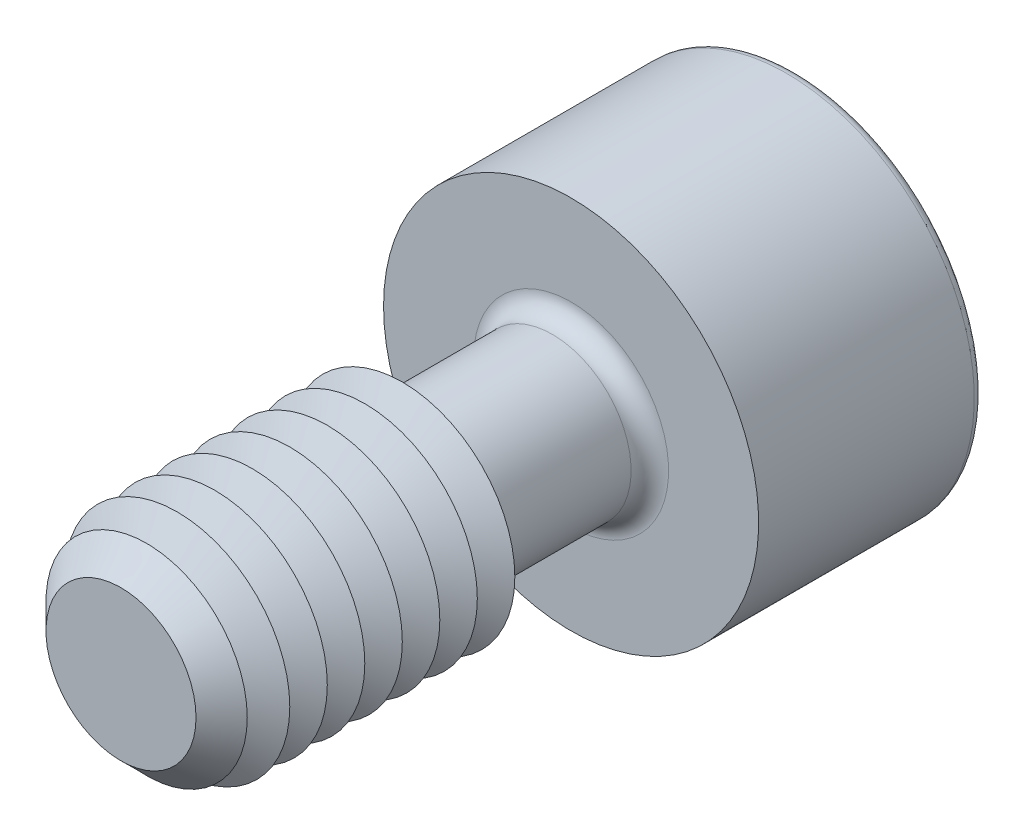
from build123d import *

# Parameters (mm, degrees)
SKETCH1_R       = 2.1
EXTRUDE1_DEPTH  = 6
CHAMFER1_SIZE   = 1
SKETCH3_R       = 5
EXTRUDE2_DEPTH  = 6
EXTRUDE3_DEPTH  = 5
FILLET1_R       = 0.5
FILLET2_R       = 0.25
LPATTERN1_COUNT = 7
LPATTERN1_PITCH = 1


with BuildPart() as part:
    # Sketch1 → Extrude1 (new, symmetric)
    with BuildSketch(Plane.XY):
        Circle(SKETCH1_R)
    extrude(amount=EXTRUDE1_DEPTH, both=True)

    # Sketch2 → Revolve1 (revolve)
    with BuildSketch(Plane(origin=(0, 0, 0), x_dir=(0, 0, -1), z_dir=(1, 0, 0))):
        Polygon((-6, 0), (-6, 3), (1.5, 3), (2.019615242, 2.1), (2.019615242, 0), align=None)
    revolve(axis=Axis((0, 0, -2.019615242), (0, 0, 1)))

    # Chamfer1
    chamfer1_edges = [part.edges().sort_by_distance(p)[0] for p in [
        (0, -3, 6),
    ]]
    chamfer(chamfer1_edges, length=CHAMFER1_SIZE)

    # Sketch3 → Extrude2 (add)
    with BuildSketch(Plane(origin=(0, 0, -6), x_dir=(-1, 0, 0), z_dir=(0, 0, -1))):
        Circle(SKETCH3_R)
    extrude(amount=EXTRUDE2_DEPTH)

    # Sketch4 → Extrude3 (cut)
    with BuildSketch(Plane(origin=(-13.7, 0, -12), x_dir=(1, 0, 0), z_dir=(0, 0, 1))):
        Polygon((12.256624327, -2.5), (15.143375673, -2.5), (16.586751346, 0), (15.143375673, 2.5), (12.256624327, 2.5), (10.813248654, 0), align=None)
    extrude(amount=EXTRUDE3_DEPTH, mode=Mode.SUBTRACT)

    # Fillet1
    fillet1_edges = [part.edges().sort_by_distance(p)[0] for p in [
        (-2.1, 0, -6),
    ]]
    fillet(fillet1_edges, radius=FILLET1_R)

    # Fillet2
    fillet2_edges = [part.edges().sort_by_distance(p)[0] for p in [
        (5, 0, -12),
    ]]
    fillet(fillet2_edges, radius=FILLET2_R)

    # Sketch5 → Cut-Revolve1 (revolve, cut)
    with BuildSketch(Plane(origin=(0, 0, 0), x_dir=(0, 0, -1), z_dir=(1, 0, 0)), mode=Mode.PRIVATE) as cut_revolve1_sk:
        Polygon((7, 0), (7, -2.5), (5.556624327, 0), align=None)
    revolve(cut_revolve1_sk.sketch.rotate(Axis((0, 0, -5.556624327), (0, 0, -1)), 90), axis=Axis((0, 0, -5.556624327), (0, 0, -1)), mode=Mode.SUBTRACT)

    # Sketch7 → Cut-Revolve2 (revolve, cut)
    with BuildSketch(Plane(origin=(0, 0, 0), x_dir=(0, 0, -1), z_dir=(1, 0, 0)), mode=Mode.PRIVATE) as cut_revolve2_sk:
        Polygon((1.5, 3), (1, 2.133974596), (0.5, 3), align=None)
    cut_revolve2 = revolve(cut_revolve2_sk.sketch.rotate(Axis((0, 0, -1.332048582), (0, 0, 1)), 90), axis=Axis((0, 0, -1.332048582), (0, 0, 1)), mode=Mode.SUBTRACT)

    # LPattern1: Cut-Revolve2 ×7
    with Locations(*[(0, 0, i * LPATTERN1_PITCH) for i in range(1, LPATTERN1_COUNT)]):
        add(cut_revolve2, mode=Mode.SUBTRACT)


solid = part.part
